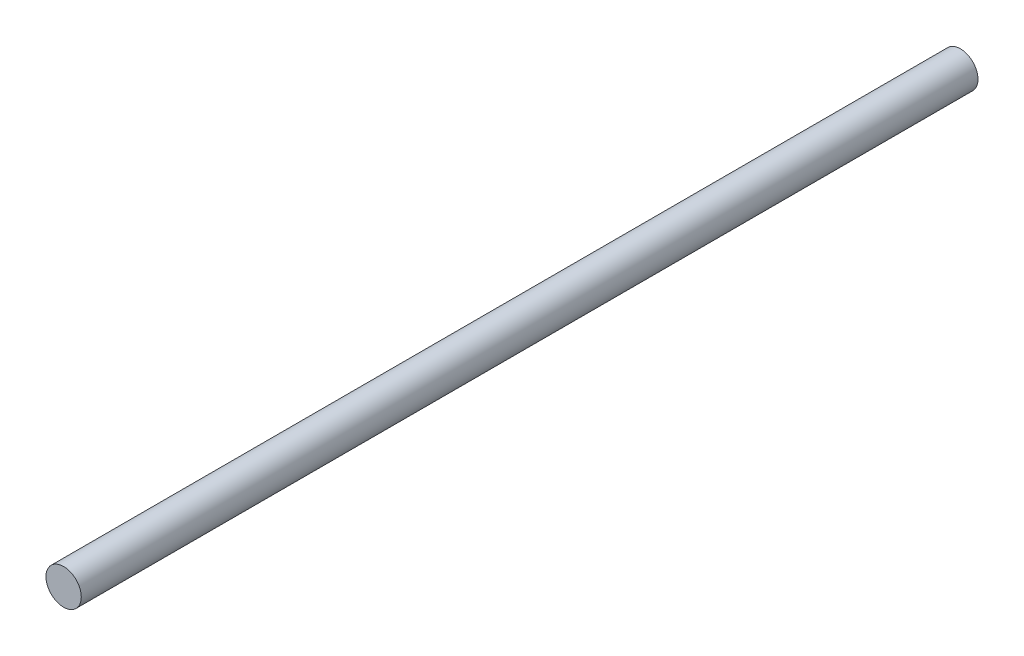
from build123d import *

# Parameters (mm, degrees)
SKETCH2_R           = 5
BOSS_EXTRUDE1_DEPTH = 254


with BuildPart() as part:
    # Sketch2 → Boss-Extrude1 (new body)
    with BuildSketch(Plane.XY):
        Circle(SKETCH2_R)
    extrude(amount=BOSS_EXTRUDE1_DEPTH)


solid = part.part
